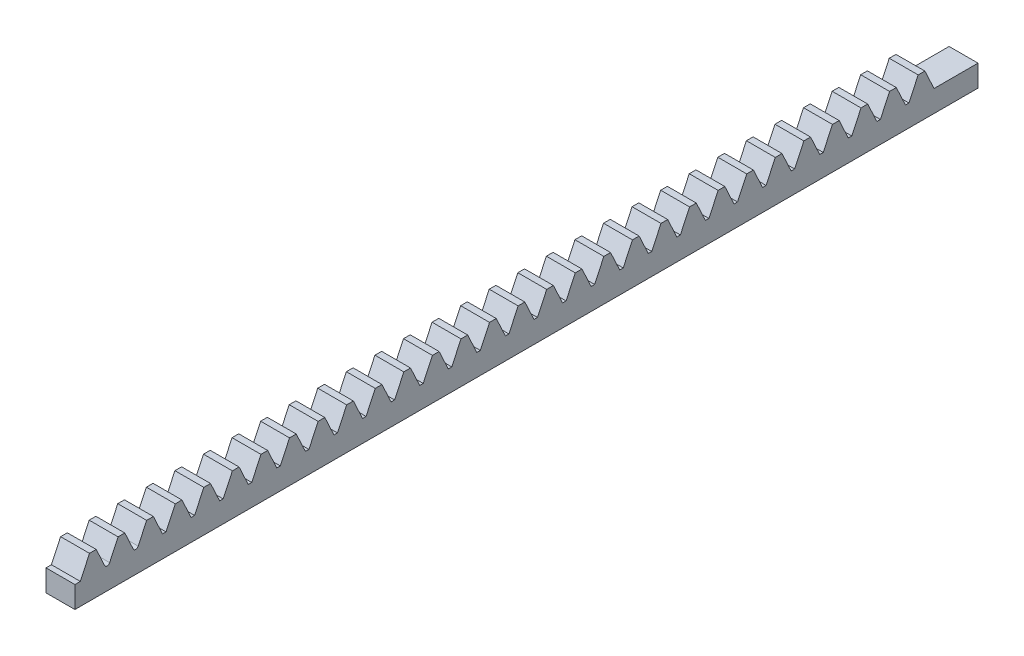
from build123d import *

# Parameters (mm, degrees)
EXTRUDE1_DEPTH = 8
SCALE2_SCALE   = 0.25
FILLET1_R      = 0.190164
FILLET2_R      = 0.190164


with BuildPart() as part:
    # Sketch4 → Extrude1 (new body)
    with BuildSketch(Plane(origin=(0, 0, 0), x_dir=(0, 0, -1), z_dir=(1, 0, 0))):
        Polygon((8.44, 6), (9.41, 6), (11.95, 11.457911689), (13.81, 11.457911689), (16.35, 6), (17.32, 6), (19.86, 11.457911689), (21.72, 11.457911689), (24.26, 6), (25.23, 6), (27.77, 11.457911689), (29.63, 11.457911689), (32.17, 6), (33.14, 6), (35.68, 11.457911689), (37.54, 11.457911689), (40.08, 6), (41.05, 6), (43.59, 11.457911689), (45.45, 11.457911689), (47.99, 6), (48.96, 6), (51.5, 11.457911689), (53.36, 11.457911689), (55.9, 6), (56.87, 6), (59.41, 11.457911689), (61.27, 11.457911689), (63.81, 6), (64.78, 6), (67.32, 11.457911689), (69.18, 11.457911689), (71.72, 6), (72.69, 6), (75.23, 11.457911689), (77.09, 11.457911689), (79.63, 6), (80.6, 6), (83.14, 11.457911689), (85, 11.457911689), (87.54, 6), (88.51, 6), (91.05, 11.457911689), (92.91, 11.457911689), (95.45, 6), (96.42, 6), (98.96, 11.457911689), (100.82, 11.457911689), (103.36, 6), (104.33, 6), (106.87, 11.457911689), (108.73, 11.457911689), (111.27, 6), (112.24, 6), (114.78, 11.457911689), (116.64, 11.457911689), (119.18, 6), (120.15, 6), (122.69, 11.457911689), (124.55, 11.457911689), (127.09, 6), (128.06, 6), (130.6, 11.457911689), (132.46, 11.457911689), (135, 6), (135.97, 6), (138.51, 11.457911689), (140.37, 11.457911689), (142.91, 6), (143.88, 6), (146.42, 11.457911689), (148.28, 11.457911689), (150.82, 6), (151.79, 6), (154.33, 11.457911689), (156.19, 11.457911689), (158.73, 6), (159.7, 6), (162.24, 11.457911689), (164.1, 11.457911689), (166.64, 6), (167.61, 6), (170.15, 11.457911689), (172.01, 11.457911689), (174.55, 6), (175.52, 6), (178.06, 11.457911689), (179.92, 11.457911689), (182.46, 6), (183.43, 6), (185.97, 11.457911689), (187.83, 11.457911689), (190.37, 6), (191.34, 6), (193.88, 11.457911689), (195.74, 11.457911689), (198.28, 6), (199.25, 6), (201.79, 11.457911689), (203.65, 11.457911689), (206.19, 6), (207.16, 6), (209.7, 11.457911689), (211.56, 11.457911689), (214.1, 6), (215.07, 6), (217.61, 11.457911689), (219.47, 11.457911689), (222.01, 6), (222.98, 6), (225.52, 11.457911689), (227.38, 11.457911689), (229.92, 6), (230.89, 6), (233.43, 11.457911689), (235.29, 11.457911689), (237.83, 6), (250, 6), (250, 0), (0, 0), (0, 6), (1.5, 6), (4.04, 11.457911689), (5.9, 11.457911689), align=None)
    extrude(amount=EXTRUDE1_DEPTH)


with BuildPart() as part_1:
    # Scale2: scaled about (4, 4.688435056, -123.269008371)
    add(part.part.scale(SCALE2_SCALE).moved(Location((3, 3.516326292, -92.451756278))))

    # Fillet1
    fillet1_edges = [part_1.edges().sort_by_distance(p)[0] for p in [
        (4, 5.016326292, -94.561756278),
        (4, 5.016326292, -94.804256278),
    ]]
    fillet(fillet1_edges, radius=FILLET1_R)

    # Fillet2
    fillet2_edges = [part_1.edges().sort_by_distance(p)[0] for p in [
        (4, 5.016326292, -96.539256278),
        (4, 5.016326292, -96.781756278),
    ]]
    fillet(fillet2_edges, radius=FILLET2_R)


solid = part_1.part
